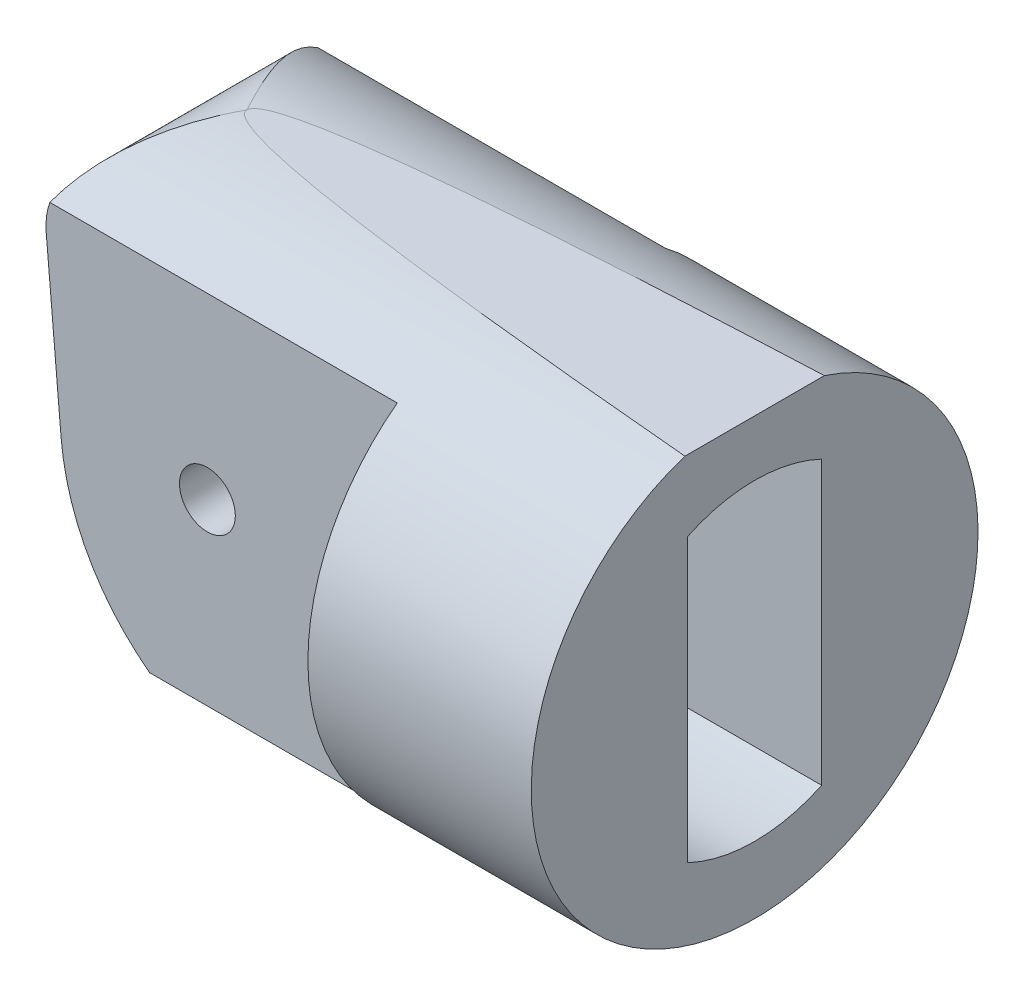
from build123d import *

# Parameters (mm, degrees)
ESQUISSE1_R                  = 10
BOSS_EXTRU_1_DEPTH           = 26
ENL_V_MAT_EXTRU_1_DEPTH      = 30.597297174
ENL_V_MAT_EXTRU_1_DEPTH_BACK = 30.597297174
ESQUISSE3_W                  = 16
ESQUISSE3_H                  = 4
ENL_V_MAT_EXTRU_2_DEPTH      = 30.597297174
ENL_V_MAT_EXTRU_2_DEPTH_BACK = 30.597297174
ESQUISSE4_R                  = 1.25
ENL_V_MAT_EXTRU_3_DEPTH      = 30.597297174
ENL_V_MAT_EXTRU_3_DEPTH_BACK = 30.597297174
ESQUISSE5_OUTSIDE_W          = 35.684
ESQUISSE5_OUTSIDE_H          = 29.684
ENL_V_MAT_EXTRU_4_DEPTH      = 30.356956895
ENL_V_MAT_EXTRU_4_DEPTH_BACK = 30.356956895
ENL_V_MAT_EXTRU_5_DEPTH      = 30.356956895
ENL_V_MAT_EXTRU_5_DEPTH_BACK = 30.356956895


with BuildPart() as part:
    # Esquisse1 → Boss.-Extru.1 (new body)
    with BuildSketch(Plane(origin=(0, 0, 0), x_dir=(0, 0, -1), z_dir=(1, 0, 0))):
        Circle(ESQUISSE1_R)
    extrude(amount=-BOSS_EXTRU_1_DEPTH)

    # Esquisse3 → Enl_v. mat.-Extru.1 (cut, two sides: drawn at the far end of the back side and taken through both)
    with BuildSketch(Plane(origin=(0, 0, 0), x_dir=(1, 0, 0), z_dir=(0, 1, 0)).offset(-ENL_V_MAT_EXTRU_1_DEPTH_BACK)):
        with Locations((-18, -8)):
            Rectangle(ESQUISSE3_W, ESQUISSE3_H)
        with Locations((-18, 8)):
            Rectangle(ESQUISSE3_W, ESQUISSE3_H)
    extrude(amount=ENL_V_MAT_EXTRU_1_DEPTH + ENL_V_MAT_EXTRU_1_DEPTH_BACK, mode=Mode.SUBTRACT)

    # Esquisse4 → Enl_v. mat.-Extru.2 (cut, two sides: drawn at the far end of the back side and taken through both)
    with BuildSketch(Plane.XY.offset(-ENL_V_MAT_EXTRU_2_DEPTH_BACK)):
        with Locations((-18.5, 0)):
            Circle(ESQUISSE4_R)
    extrude(amount=ENL_V_MAT_EXTRU_2_DEPTH + ENL_V_MAT_EXTRU_2_DEPTH_BACK, mode=Mode.SUBTRACT)

    # Esquisse5 outside → Enl_v. mat.-Extru.3 (cut, two sides: drawn at the far end of the back side and taken through both)
    with BuildSketch(Plane.XY.offset(-ENL_V_MAT_EXTRU_3_DEPTH_BACK)):
        with Locations((-13, 0)):
            Rectangle(ESQUISSE5_OUTSIDE_W, ESQUISSE5_OUTSIDE_H)
        with BuildLine():
            Line((-25.714658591, 6.738532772), (-25.04886197, -0.871557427))
            ThreePointArc((-25.04886197, -0.871557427), (-21.842817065, -7.372773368), (-15.086914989, -10))
            Line((-15.086914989, -10), (0, -10))
            Line((0, -10), (0, 10))
            Line((0, 10), (-22.726074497, 10))
            ThreePointArc((-22.726074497, 10), (-24.937906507, 9.026770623), (-25.714658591, 6.738532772))
        make_face(mode=Mode.SUBTRACT)
    extrude(amount=ENL_V_MAT_EXTRU_3_DEPTH + ENL_V_MAT_EXTRU_3_DEPTH_BACK, mode=Mode.SUBTRACT)

    # Esquisse6 → Enl_v. mat.-Extru.4 (cut, two sides: drawn at the far end of the back side and taken through both)
    with BuildSketch(Plane.XY.offset(-ENL_V_MAT_EXTRU_4_DEPTH_BACK)):
        Polygon((-22.726074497, 10), (0, 9.5), (0, 10), align=None)
    extrude(amount=ENL_V_MAT_EXTRU_4_DEPTH + ENL_V_MAT_EXTRU_4_DEPTH_BACK, mode=Mode.SUBTRACT)

    # Esquisse7 → Enl_v. mat.-Extru.5 (cut, two sides: drawn at the far end of the back side and taken through both)
    with BuildSketch(Plane(origin=(0, 0, 0), x_dir=(0, 0, -1), z_dir=(1, 0, 0)).offset(-ENL_V_MAT_EXTRU_5_DEPTH_BACK)):
        with BuildLine():
            Line((3, -6.32455532), (3, 6.32455532))
            ThreePointArc((3, 6.32455532), (1.537548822, 6.829051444), (0, 7))
            ThreePointArc((0, 7), (-1.537548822, 6.829051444), (-3, 6.32455532))
            Line((-3, 6.32455532), (-3, -6.32455532))
            ThreePointArc((-3, -6.32455532), (-1.537548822, -6.829051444), (0, -7))
            ThreePointArc((0, -7), (1.537548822, -6.829051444), (3, -6.32455532))
        make_face()
    extrude(amount=ENL_V_MAT_EXTRU_5_DEPTH + ENL_V_MAT_EXTRU_5_DEPTH_BACK, mode=Mode.SUBTRACT)


solid = part.part
